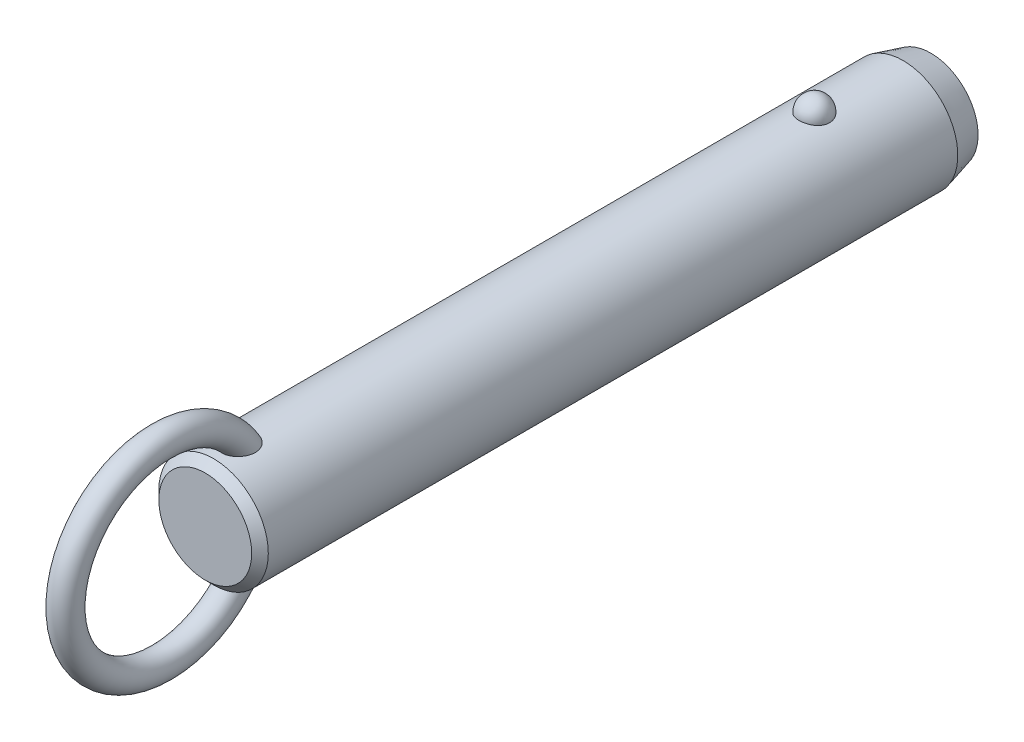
ISO-10303-21;
HEADER;
FILE_DESCRIPTION(('STEP AP214'),'2;1');
FILE_NAME('part.step','',(''),(''),'','','');
FILE_SCHEMA(('AUTOMOTIVE_DESIGN { 1 0 10303 214 1 1 1 1 }'));
ENDSEC;
DATA;
#1=APPLICATION_CONTEXT('core data for automotive mechanical design processes');
#2=APPLICATION_PROTOCOL_DEFINITION('international standard','automotive_design',2000,#1);
#3=PRODUCT_CONTEXT('',#1,'mechanical');
#4=PRODUCT('Part','Part','',(#3));
#5=PRODUCT_RELATED_PRODUCT_CATEGORY('part','',(#4));
#6=PRODUCT_DEFINITION_FORMATION('','',#4);
#7=PRODUCT_DEFINITION_CONTEXT('part definition',#1,'design');
#8=PRODUCT_DEFINITION('design','',#6,#7);
#9=PRODUCT_DEFINITION_SHAPE('','',#8);
#10=(LENGTH_UNIT() NAMED_UNIT(*) SI_UNIT(.MILLI.,.METRE.));
#11=(NAMED_UNIT(*) PLANE_ANGLE_UNIT() SI_UNIT($,.RADIAN.));
#12=(NAMED_UNIT(*) SI_UNIT($,.STERADIAN.) SOLID_ANGLE_UNIT());
#13=UNCERTAINTY_MEASURE_WITH_UNIT(LENGTH_MEASURE(1.E-05),#10,'distance_accuracy_value','');
#14=(GEOMETRIC_REPRESENTATION_CONTEXT(3) GLOBAL_UNCERTAINTY_ASSIGNED_CONTEXT((#13)) GLOBAL_UNIT_ASSIGNED_CONTEXT((#10,
#11,#12)) REPRESENTATION_CONTEXT('',''));
#15=CARTESIAN_POINT('',(0.,0.,0.));
#16=DIRECTION('',(0.,0.,1.));
#17=DIRECTION('',(1.,0.,0.));
#18=AXIS2_PLACEMENT_3D('',#15,#16,#17);
#19=CARTESIAN_POINT('',(0.,0.,76.2));
#20=DIRECTION('',(0.,0.,-1.));
#21=DIRECTION('',(-1.,0.,0.));
#22=AXIS2_PLACEMENT_3D('',#19,#20,#21);
#23=CYLINDRICAL_SURFACE('',#22,7.9);
#24=CARTESIAN_POINT('',(2.1785689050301,7.59367088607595,-2.19999999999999));
#25=CARTESIAN_POINT('',(2.17856679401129,7.59367269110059,-2.07701843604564));
#26=CARTESIAN_POINT('',(2.16853481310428,7.59657145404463,-1.95401006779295));
#27=CARTESIAN_POINT('',(2.12864689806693,7.607843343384,-1.71147811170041));
#28=CARTESIAN_POINT('',(2.09878338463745,7.61621856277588,-1.59195587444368));
#29=CARTESIAN_POINT('',(2.0199931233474,7.63749180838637,-1.3598563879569));
#30=CARTESIAN_POINT('',(1.97107475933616,7.65038784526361,-1.24727610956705));
#31=CARTESIAN_POINT('',(1.85539377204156,7.67926115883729,-1.03213234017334));
#32=CARTESIAN_POINT('',(1.78863158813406,7.69523835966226,-0.929568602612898));
#33=CARTESIAN_POINT('',(1.63856494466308,7.7285848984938,-0.736786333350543));
#34=CARTESIAN_POINT('',(1.55518140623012,7.7459606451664,-0.646630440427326));
#35=CARTESIAN_POINT('',(1.37422937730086,7.78009978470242,-0.481747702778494));
#36=CARTESIAN_POINT('',(1.27666086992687,7.7968631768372,-0.407020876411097));
#37=CARTESIAN_POINT('',(1.07024728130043,7.82786153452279,-0.275278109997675));
#38=CARTESIAN_POINT('',(0.961434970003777,7.84210353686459,-0.218212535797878));
#39=CARTESIAN_POINT('',(0.735351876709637,7.86652194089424,-0.123146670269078));
#40=CARTESIAN_POINT('',(0.618082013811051,7.87669878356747,-0.0851443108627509));
#41=CARTESIAN_POINT('',(0.380637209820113,7.89170521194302,-0.0298158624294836));
#42=CARTESIAN_POINT('',(0.260550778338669,7.89662650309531,-0.0121347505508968));
#43=CARTESIAN_POINT('',(0.0190117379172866,7.90090003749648,0.00324379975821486));
#44=CARTESIAN_POINT('',(-0.10244074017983,7.90025280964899,0.000943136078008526));
#45=CARTESIAN_POINT('',(-0.341452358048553,7.89351056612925,-0.0233955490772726));
#46=CARTESIAN_POINT('',(-0.45904225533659,7.88749257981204,-0.0451545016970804));
#47=CARTESIAN_POINT('',(-0.688796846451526,7.87075812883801,-0.107408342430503));
#48=CARTESIAN_POINT('',(-0.800961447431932,7.86004158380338,-0.147903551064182));
#49=CARTESIAN_POINT('',(-1.01743634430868,7.83497131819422,-0.246799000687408));
#50=CARTESIAN_POINT('',(-1.12169791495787,7.82059709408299,-0.305300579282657));
#51=CARTESIAN_POINT('',(-1.31891765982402,7.78976470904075,-0.438549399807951));
#52=CARTESIAN_POINT('',(-1.41187469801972,7.77330633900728,-0.513298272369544));
#53=CARTESIAN_POINT('',(-1.58577142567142,7.73972434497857,-0.678622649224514));
#54=CARTESIAN_POINT('',(-1.66645140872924,7.72259402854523,-0.769470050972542));
#55=CARTESIAN_POINT('',(-1.81161503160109,7.68983776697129,-0.963538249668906));
#56=CARTESIAN_POINT('',(-1.87609753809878,7.6742119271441,-1.06675991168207));
#57=CARTESIAN_POINT('',(-1.98790138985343,7.6460202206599,-1.28401170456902));
#58=CARTESIAN_POINT('',(-2.03501994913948,7.63349104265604,-1.39815107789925));
#59=CARTESIAN_POINT('',(-2.10986724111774,7.6131449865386,-1.63301784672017));
#60=CARTESIAN_POINT('',(-2.1375965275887,7.60532797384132,-1.75374505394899));
#61=CARTESIAN_POINT('',(-2.17289256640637,7.59531950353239,-1.99782562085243));
#62=CARTESIAN_POINT('',(-2.18054294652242,7.59310471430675,-2.12116592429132));
#63=CARTESIAN_POINT('',(-2.17572919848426,7.59448538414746,-2.36741799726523));
#64=CARTESIAN_POINT('',(-2.1632656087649,7.59808068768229,-2.49032977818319));
#65=CARTESIAN_POINT('',(-2.11865035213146,7.61064035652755,-2.73161015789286));
#66=CARTESIAN_POINT('',(-2.08659579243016,7.61957823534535,-2.84999812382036));
#67=CARTESIAN_POINT('',(-2.00367799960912,7.64179982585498,-3.07955956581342));
#68=CARTESIAN_POINT('',(-1.9528140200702,7.65508371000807,-3.19073275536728));
#69=CARTESIAN_POINT('',(-1.83321113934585,7.68460381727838,-3.40337899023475));
#70=CARTESIAN_POINT('',(-1.76437735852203,7.70085556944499,-3.50479651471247));
#71=CARTESIAN_POINT('',(-1.61069526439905,7.73445734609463,-3.69446912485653));
#72=CARTESIAN_POINT('',(-1.52584634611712,7.75180741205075,-3.78272371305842));
#73=CARTESIAN_POINT('',(-1.34198059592,7.78574608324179,-3.94393987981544));
#74=CARTESIAN_POINT('',(-1.24291308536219,7.80233167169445,-4.01684434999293));
#75=CARTESIAN_POINT('',(-1.03352039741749,7.83281625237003,-4.14489386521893));
#76=CARTESIAN_POINT('',(-0.923196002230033,7.84671543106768,-4.20004014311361));
#77=CARTESIAN_POINT('',(-0.695822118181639,7.87011575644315,-4.29042017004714));
#78=CARTESIAN_POINT('',(-0.578872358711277,7.87966903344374,-4.32589112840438));
#79=CARTESIAN_POINT('',(-0.340410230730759,7.8935652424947,-4.37692226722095));
#80=CARTESIAN_POINT('',(-0.218898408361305,7.89790879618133,-4.39248482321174));
#81=CARTESIAN_POINT('',(0.0228107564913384,7.90087453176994,-4.40314405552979));
#82=CARTESIAN_POINT('',(0.142990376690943,7.89960185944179,-4.39861683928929));
#83=CARTESIAN_POINT('',(0.380829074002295,7.89171262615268,-4.37008293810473));
#84=CARTESIAN_POINT('',(0.498488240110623,7.8850962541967,-4.34607694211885));
#85=CARTESIAN_POINT('',(0.727535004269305,7.86726442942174,-4.27939317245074));
#86=CARTESIAN_POINT('',(0.838944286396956,7.85606616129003,-4.236785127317));
#87=CARTESIAN_POINT('',(1.05295421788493,7.83025654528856,-4.13408348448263));
#88=CARTESIAN_POINT('',(1.15555431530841,7.81564498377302,-4.07398879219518));
#89=CARTESIAN_POINT('',(1.35076763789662,7.7843022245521,-3.93687432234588));
#90=CARTESIAN_POINT('',(1.4432046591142,7.76754209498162,-3.85961036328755));
#91=CARTESIAN_POINT('',(1.6139111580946,7.73387857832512,-3.69076949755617));
#92=CARTESIAN_POINT('',(1.6921781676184,7.71697516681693,-3.59919010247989));
#93=CARTESIAN_POINT('',(1.83380875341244,7.6845643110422,-3.40247278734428));
#94=CARTESIAN_POINT('',(1.89689280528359,7.66908588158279,-3.29712873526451));
#95=CARTESIAN_POINT('',(2.0047823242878,7.64159441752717,-3.07707931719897));
#96=CARTESIAN_POINT('',(2.0495945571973,7.62958010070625,-2.96237743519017));
#97=CARTESIAN_POINT('',(2.11580183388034,7.61146617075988,-2.74040519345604));
#98=CARTESIAN_POINT('',(2.13929812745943,7.60484503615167,-2.63379846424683));
#99=CARTESIAN_POINT('',(2.17068242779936,7.59594664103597,-2.41813481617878));
#100=CARTESIAN_POINT('',(2.17857077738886,7.59366928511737,-2.30907795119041));
#101=CARTESIAN_POINT('',(2.1785689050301,7.59367088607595,-2.19999999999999));
#102=B_SPLINE_CURVE_WITH_KNOTS('',3,(#24,#25,#26,#27,#28,#29,#30,#31,#32,#33,#34,#35,#36,#37,
#38,#39,#40,#41,#42,#43,#44,#45,#46,#47,#48,#49,#50,#51,#52,#53,#54,#55,#56,#57,#58,#59,#60,#61,
#62,#63,#64,#65,#66,#67,#68,#69,#70,#71,#72,#73,#74,#75,#76,#77,#78,#79,#80,#81,#82,#83,#84,#85,
#86,#87,#88,#89,#90,#91,#92,#93,#94,#95,#96,#97,#98,#99,#100,#101),.UNSPECIFIED.,.T.,.F.,(4,2,2,
2,2,2,2,2,2,2,2,2,2,2,2,2,2,2,2,2,2,2,2,2,2,2,2,2,2,2,2,2,2,2,2,2,2,2,4),(0.,0.368552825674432,
0.737246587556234,1.10577831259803,1.4743009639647,1.84462067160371,2.21494081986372,
2.58421058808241,2.95344028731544,3.31611630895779,3.67875788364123,4.03628044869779,
4.39380913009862,4.75338791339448,5.11300280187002,5.47939989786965,5.8458226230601,
6.21639834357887,6.58696347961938,6.95598276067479,7.32499216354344,7.69218715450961,
8.0593967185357,8.42858578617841,8.79778880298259,9.16834203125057,9.5388695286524,
9.90482699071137,10.2707407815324,10.6298333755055,10.9889132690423,11.3466585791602,
11.7044262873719,12.0676511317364,12.4309391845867,12.8004764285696,13.1698767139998,
13.4967701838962,13.8236564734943),.UNSPECIFIED.);
#103=CARTESIAN_POINT('',(2.1785689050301,7.59367088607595,-2.19999999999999));
#104=VERTEX_POINT('',#103);
#105=EDGE_CURVE('E41',#104,#104,#102,.T.);
#106=ORIENTED_EDGE('',*,*,#105,.T.);
#107=EDGE_LOOP('',(#106));
#108=FACE_BOUND('',#107,.T.);
#109=CARTESIAN_POINT('',(0.,0.,84.52));
#110=DIRECTION('',(0.,0.,1.));
#111=DIRECTION('',(1.,0.,0.));
#112=AXIS2_PLACEMENT_3D('',#109,#110,#111);
#113=CIRCLE('',#112,7.9);
#114=CARTESIAN_POINT('',(7.9,0.,84.52));
#115=VERTEX_POINT('',#114);
#116=EDGE_CURVE('E10',#115,#115,#113,.F.);
#117=ORIENTED_EDGE('',*,*,#116,.T.);
#118=EDGE_LOOP('',(#117));
#119=FACE_BOUND('',#118,.T.);
#120=CARTESIAN_POINT('',(-0.630969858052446,-7.87476203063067,78.4124322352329));
#121=CARTESIAN_POINT('',(-0.734180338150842,-7.8664899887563,78.447285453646));
#122=CARTESIAN_POINT('',(-0.834476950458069,-7.85639291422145,78.4908160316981));
#123=CARTESIAN_POINT('',(-1.0262035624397,-7.83366343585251,78.5940948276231));
#124=CARTESIAN_POINT('',(-1.1176141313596,-7.82102565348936,78.6538775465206));
#125=CARTESIAN_POINT('',(-1.28877277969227,-7.79464922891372,78.7878390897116));
#126=CARTESIAN_POINT('',(-1.36854014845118,-7.78091246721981,78.861993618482));
#127=CARTESIAN_POINT('',(-1.5146152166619,-7.75380398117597,79.0224941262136));
#128=CARTESIAN_POINT('',(-1.58092966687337,-7.74043207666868,79.1088339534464));
#129=CARTESIAN_POINT('',(-1.70019064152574,-7.71512522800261,79.2929784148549));
#130=CARTESIAN_POINT('',(-1.75284037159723,-7.70322473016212,79.3909792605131));
#131=CARTESIAN_POINT('',(-1.84263464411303,-7.68224112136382,79.5941029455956));
#132=CARTESIAN_POINT('',(-1.87977299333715,-7.6731591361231,79.6992286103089));
#133=CARTESIAN_POINT('',(-1.94152728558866,-7.65777930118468,79.9232849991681));
#134=CARTESIAN_POINT('',(-1.96475471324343,-7.65179654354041,80.0426167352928));
#135=CARTESIAN_POINT('',(-1.99449499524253,-7.64409642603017,80.2834298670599));
#136=CARTESIAN_POINT('',(-2.0010005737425,-7.64238092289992,80.4049121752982));
#137=CARTESIAN_POINT('',(-1.99856014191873,-7.64302120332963,80.6683409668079));
#138=CARTESIAN_POINT('',(-1.98680021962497,-7.64611845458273,80.8102565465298));
#139=CARTESIAN_POINT('',(-1.94457772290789,-7.65696186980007,81.0911188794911));
#140=CARTESIAN_POINT('',(-1.91409393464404,-7.66471330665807,81.2300620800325));
#141=CARTESIAN_POINT('',(-1.82768670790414,-7.68582947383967,81.531939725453));
#142=CARTESIAN_POINT('',(-1.76772963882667,-7.70003779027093,81.693686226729));
#143=CARTESIAN_POINT('',(-1.65998501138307,-7.72371550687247,81.9276956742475));
#144=CARTESIAN_POINT('',(-1.621079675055,-7.73200670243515,82.0042974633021));
#145=CARTESIAN_POINT('',(-1.53727726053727,-7.74910377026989,82.1540798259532));
#146=CARTESIAN_POINT('',(-1.49238215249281,-7.75790947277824,82.2272615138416));
#147=CARTESIAN_POINT('',(-1.3739705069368,-7.77993338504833,82.4028838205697));
#148=CARTESIAN_POINT('',(-1.29690364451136,-7.79328473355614,82.5029557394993));
#149=CARTESIAN_POINT('',(-1.12885487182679,-7.81939266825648,82.6907147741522));
#150=CARTESIAN_POINT('',(-1.03789926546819,-7.83215032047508,82.7784247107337));
#151=CARTESIAN_POINT('',(-0.869532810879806,-7.85231710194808,82.9134148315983));
#152=CARTESIAN_POINT('',(-0.795716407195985,-7.86021093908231,82.965076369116));
#153=CARTESIAN_POINT('',(-0.640813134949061,-7.87434920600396,83.0563815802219));
#154=CARTESIAN_POINT('',(-0.559737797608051,-7.88059619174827,83.0960438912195));
#155=CARTESIAN_POINT('',(-0.406456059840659,-7.88984116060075,83.1543008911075));
#156=CARTESIAN_POINT('',(-0.335227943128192,-7.89321892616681,83.1753848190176));
#157=CARTESIAN_POINT('',(-0.190193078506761,-7.89804235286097,83.2054141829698));
#158=CARTESIAN_POINT('',(-0.116388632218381,-7.89948969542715,83.2143701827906));
#159=CARTESIAN_POINT('',(0.0318414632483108,-7.90028409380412,83.2192915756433));
#160=CARTESIAN_POINT('',(0.106268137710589,-7.89962640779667,83.2152276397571));
#161=CARTESIAN_POINT('',(0.253290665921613,-7.8962818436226,83.1944615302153));
#162=CARTESIAN_POINT('',(0.32588518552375,-7.8935935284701,83.1777504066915));
#163=CARTESIAN_POINT('',(0.481441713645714,-7.88577340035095,83.1287380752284));
#164=CARTESIAN_POINT('',(0.563611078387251,-7.88026321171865,83.094005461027));
#165=CARTESIAN_POINT('',(0.721129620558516,-7.86741729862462,83.0117965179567));
#166=CARTESIAN_POINT('',(0.796466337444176,-7.86007832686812,82.9642975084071));
#167=CARTESIAN_POINT('',(0.971456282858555,-7.84073285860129,82.836513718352));
#168=CARTESIAN_POINT('',(1.06719686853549,-7.82809461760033,82.7510047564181));
#169=CARTESIAN_POINT('',(1.24418921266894,-7.80192439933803,82.566232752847));
#170=CARTESIAN_POINT('',(1.32540832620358,-7.78839049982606,82.4669395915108));
#171=CARTESIAN_POINT('',(1.45199971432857,-7.76559693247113,82.2895760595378));
#172=CARTESIAN_POINT('',(1.5008564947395,-7.75626094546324,82.2139542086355));
#173=CARTESIAN_POINT('',(1.59197749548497,-7.7380727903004,82.0587428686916));
#174=CARTESIAN_POINT('',(1.63423919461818,-7.72922080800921,81.9791518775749));
#175=CARTESIAN_POINT('',(1.71222612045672,-7.71231959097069,81.8166640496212));
#176=CARTESIAN_POINT('',(1.7479451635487,-7.70427111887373,81.733764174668));
#177=CARTESIAN_POINT('',(1.81270113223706,-7.68929240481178,81.5652967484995));
#178=CARTESIAN_POINT('',(1.84173789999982,-7.68236218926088,81.4797291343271));
#179=CARTESIAN_POINT('',(1.89322698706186,-7.6698375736,81.3052870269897));
#180=CARTESIAN_POINT('',(1.91558744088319,-7.66426199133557,81.2163838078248));
#181=CARTESIAN_POINT('',(1.95281367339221,-7.65485915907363,81.0369696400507));
#182=CARTESIAN_POINT('',(1.96767946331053,-7.65103190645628,80.9464586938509));
#183=CARTESIAN_POINT('',(2.00021456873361,-7.64262981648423,80.6737320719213));
#184=CARTESIAN_POINT('',(2.00600691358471,-7.6410871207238,80.4897099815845));
#185=CARTESIAN_POINT('',(1.98445334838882,-7.64669564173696,80.1765019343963));
#186=CARTESIAN_POINT('',(1.96607186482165,-7.65149688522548,80.046618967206));
#187=CARTESIAN_POINT('',(1.90884967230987,-7.6659762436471,79.7916321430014));
#188=CARTESIAN_POINT('',(1.87002101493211,-7.67565148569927,79.666525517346));
#189=CARTESIAN_POINT('',(1.77063986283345,-7.69918471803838,79.4245401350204));
#190=CARTESIAN_POINT('',(1.7099372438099,-7.71307150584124,79.3077250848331));
#191=CARTESIAN_POINT('',(1.56733070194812,-7.74330306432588,79.0881444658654));
#192=CARTESIAN_POINT('',(1.48543692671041,-7.75964665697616,78.9853722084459));
#193=CARTESIAN_POINT('',(1.31346177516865,-7.79047523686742,78.8093800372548));
#194=CARTESIAN_POINT('',(1.22547278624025,-7.80495298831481,78.7341066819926));
#195=CARTESIAN_POINT('',(1.03724352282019,-7.83218597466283,78.6004864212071));
#196=CARTESIAN_POINT('',(0.937008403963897,-7.84494192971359,78.5421324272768));
#197=CARTESIAN_POINT('',(0.733599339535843,-7.86649045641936,78.4470270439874));
#198=CARTESIAN_POINT('',(0.630941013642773,-7.87547134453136,78.4092109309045));
#199=CARTESIAN_POINT('',(0.420465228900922,-7.88950708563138,78.3511160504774));
#200=CARTESIAN_POINT('',(0.312645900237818,-7.89456050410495,78.3308436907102));
#201=CARTESIAN_POINT('',(0.0960869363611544,-7.9001518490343,78.3084559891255));
#202=CARTESIAN_POINT('',(-0.0126341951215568,-7.90073226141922,78.3061698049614));
#203=CARTESIAN_POINT('',(-0.228766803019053,-7.89742350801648,78.3193678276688));
#204=CARTESIAN_POINT('',(-0.336180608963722,-7.89354403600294,78.3348134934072));
#205=CARTESIAN_POINT('',(-0.473410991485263,-7.88586871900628,78.3662177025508));
#206=CARTESIAN_POINT('',(-0.5052577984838,-7.88388984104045,78.3743541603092));
#207=CARTESIAN_POINT('',(-0.568481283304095,-7.87958326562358,78.3922083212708));
#208=CARTESIAN_POINT('',(-0.599857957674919,-7.87725556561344,78.4019260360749));
#209=CARTESIAN_POINT('',(-0.630969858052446,-7.87476203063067,78.4124322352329));
#210=B_SPLINE_CURVE_WITH_KNOTS('',3,(#120,#121,#122,#123,#124,#125,#126,#127,#128,#129,#130,
#131,#132,#133,#134,#135,#136,#137,#138,#139,#140,#141,#142,#143,#144,#145,#146,#147,#148,#149,
#150,#151,#152,#153,#154,#155,#156,#157,#158,#159,#160,#161,#162,#163,#164,#165,#166,#167,#168,
#169,#170,#171,#172,#173,#174,#175,#176,#177,#178,#179,#180,#181,#182,#183,#184,#185,#186,#187,
#188,#189,#190,#191,#192,#193,#194,#195,#196,#197,#198,#199,#200,#201,#202,#203,#204,#205,#206,
#207,#208,#209),.UNSPECIFIED.,.T.,.F.,(4,2,2,2,2,2,2,2,2,2,2,2,2,2,2,2,2,2,2,2,2,2,2,2,2,2,2,2,
2,2,2,2,2,2,2,2,2,2,2,2,2,2,2,2,4),(0.,0.327622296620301,0.655945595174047,0.983718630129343,
1.3113267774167,1.64554655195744,1.97989964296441,2.3436572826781,2.70757317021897,
3.13333684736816,3.55958380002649,4.07655306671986,4.33527897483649,4.59391999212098,
4.9738243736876,5.35301797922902,5.62348245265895,5.89352465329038,6.11565959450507,
6.3376009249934,6.56004255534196,6.78264174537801,7.04930844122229,7.31645206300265,
7.70130871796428,8.08701995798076,8.35824509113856,8.62957365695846,8.9011573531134,
9.17274746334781,9.44791855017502,9.72308922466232,10.2715298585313,10.6638393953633,
11.0559179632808,11.4507403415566,11.845374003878,12.1936425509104,12.5417649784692,
12.8695063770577,13.1973674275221,13.5221104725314,13.8461490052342,13.9449071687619,
14.0436660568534),.UNSPECIFIED.);
#211=CARTESIAN_POINT('',(-0.630969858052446,-7.87476203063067,78.4124322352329));
#212=VERTEX_POINT('',#211);
#213=EDGE_CURVE('E60',#212,#212,#210,.T.);
#214=ORIENTED_EDGE('',*,*,#213,.T.);
#215=EDGE_LOOP('',(#214));
#216=FACE_BOUND('',#215,.T.);
#217=CARTESIAN_POINT('',(-0.630969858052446,7.87476203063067,78.4124322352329));
#218=CARTESIAN_POINT('',(-0.52891882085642,7.88293636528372,78.3779798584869));
#219=CARTESIAN_POINT('',(-0.423745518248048,7.8893481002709,78.351915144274));
#220=CARTESIAN_POINT('',(-0.210236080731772,7.8979273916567,78.3172825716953));
#221=CARTESIAN_POINT('',(-0.101893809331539,7.90008607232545,78.3087513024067));
#222=CARTESIAN_POINT('',(0.114660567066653,7.89990877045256,78.3094570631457));
#223=CARTESIAN_POINT('',(0.222872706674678,7.89757640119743,78.3186798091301));
#224=CARTESIAN_POINT('',(0.436107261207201,7.88867538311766,78.3546525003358));
#225=CARTESIAN_POINT('',(0.541131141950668,7.8821087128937,78.3813942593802));
#226=CARTESIAN_POINT('',(0.745085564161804,7.86545130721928,78.4517561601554));
#227=CARTESIAN_POINT('',(0.844015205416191,7.85536005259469,78.4953787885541));
#228=CARTESIAN_POINT('',(1.03299167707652,7.83275153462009,78.5983796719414));
#229=CARTESIAN_POINT('',(1.12303841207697,7.8202342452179,78.6577580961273));
#230=CARTESIAN_POINT('',(1.29214734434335,7.79408219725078,78.7908647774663));
#231=CARTESIAN_POINT('',(1.37116907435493,7.78044359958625,78.8646436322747));
#232=CARTESIAN_POINT('',(1.51597677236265,7.75353170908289,79.0242353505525));
#233=CARTESIAN_POINT('',(1.58176261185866,7.74025841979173,79.1100483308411));
#234=CARTESIAN_POINT('',(1.70057386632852,7.71504069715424,79.293644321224));
#235=CARTESIAN_POINT('',(1.75320073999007,7.7031425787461,79.3916906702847));
#236=CARTESIAN_POINT('',(1.8429376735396,7.68216822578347,79.5948931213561));
#237=CARTESIAN_POINT('',(1.88004278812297,7.67309289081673,79.7000514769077));
#238=CARTESIAN_POINT('',(1.9417232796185,7.6577294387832,79.9241671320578));
#239=CARTESIAN_POINT('',(1.96491037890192,7.65175648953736,80.0435248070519));
#240=CARTESIAN_POINT('',(1.9945689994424,7.64407702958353,80.2843848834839));
#241=CARTESIAN_POINT('',(2.00103304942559,7.64237242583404,80.4058882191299));
#242=CARTESIAN_POINT('',(1.9985016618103,7.64303650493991,80.6693688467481));
#243=CARTESIAN_POINT('',(1.98669038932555,7.64614714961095,80.8113141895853));
#244=CARTESIAN_POINT('',(1.94436120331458,7.6570170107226,81.0922287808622));
#245=CARTESIAN_POINT('',(1.9138220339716,7.66478150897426,81.2311944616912));
#246=CARTESIAN_POINT('',(1.82728754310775,7.68592483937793,81.5331110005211));
#247=CARTESIAN_POINT('',(1.76725778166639,7.7001468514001,81.694872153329));
#248=CARTESIAN_POINT('',(1.65939700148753,7.72384204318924,81.9288914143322));
#249=CARTESIAN_POINT('',(1.62045187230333,7.73213852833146,82.0054942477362));
#250=CARTESIAN_POINT('',(1.53656684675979,7.74924489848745,82.1552737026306));
#251=CARTESIAN_POINT('',(1.49162892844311,7.75805461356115,82.2284514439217));
#252=CARTESIAN_POINT('',(1.37317698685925,7.78007342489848,82.4039520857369));
#253=CARTESIAN_POINT('',(1.29612360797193,7.79341423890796,82.5039112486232));
#254=CARTESIAN_POINT('',(1.12812043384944,7.81949839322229,82.6914508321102));
#255=CARTESIAN_POINT('',(1.03719688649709,7.83224280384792,82.7790540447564));
#256=CARTESIAN_POINT('',(0.868871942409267,7.85239026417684,82.9138971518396));
#257=CARTESIAN_POINT('',(0.795056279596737,7.86027769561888,82.9655113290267));
#258=CARTESIAN_POINT('',(0.640160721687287,7.87440222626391,83.0567201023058));
#259=CARTESIAN_POINT('',(0.559092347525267,7.88064188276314,83.0963333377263));
#260=CARTESIAN_POINT('',(0.405820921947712,7.8898738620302,83.1545056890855));
#261=CARTESIAN_POINT('',(0.33459413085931,7.89324577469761,83.1755523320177));
#262=CARTESIAN_POINT('',(0.189568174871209,7.89805733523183,83.2055070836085));
#263=CARTESIAN_POINT('',(0.115771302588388,7.89949866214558,83.2144257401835));
#264=CARTESIAN_POINT('',(-0.032435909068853,7.90028156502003,83.2192758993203));
#265=CARTESIAN_POINT('',(-0.106847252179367,7.89961843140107,83.2151782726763));
#266=CARTESIAN_POINT('',(-0.253834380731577,7.8962642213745,83.1943519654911));
#267=CARTESIAN_POINT('',(-0.326408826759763,7.89357170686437,83.1776143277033));
#268=CARTESIAN_POINT('',(-0.481962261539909,7.88574179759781,83.1285391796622));
#269=CARTESIAN_POINT('',(-0.564145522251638,7.88022507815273,83.0937638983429));
#270=CARTESIAN_POINT('',(-0.721685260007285,7.8673664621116,83.0114686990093));
#271=CARTESIAN_POINT('',(-0.797029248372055,7.8600213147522,82.9639260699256));
#272=CARTESIAN_POINT('',(-0.972044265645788,7.84066026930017,82.8360267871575));
#273=CARTESIAN_POINT('',(-1.06779803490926,7.82801274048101,82.7504436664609));
#274=CARTESIAN_POINT('',(-1.24480531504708,7.80182621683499,82.5655223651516));
#275=CARTESIAN_POINT('',(-1.32602618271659,7.78828530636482,82.4661540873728));
#276=CARTESIAN_POINT('',(-1.45259834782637,7.76548487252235,82.2886806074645));
#277=CARTESIAN_POINT('',(-1.50143856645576,7.75614818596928,82.2130252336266));
#278=CARTESIAN_POINT('',(-1.59252410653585,7.73796020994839,82.0577484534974));
#279=CARTESIAN_POINT('',(-1.63476690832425,7.72910910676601,81.9781255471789));
#280=CARTESIAN_POINT('',(-1.71271318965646,7.71221133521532,81.8155750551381));
#281=CARTESIAN_POINT('',(-1.74841047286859,7.70416543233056,81.7326444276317));
#282=CARTESIAN_POINT('',(-1.81311929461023,7.6891937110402,81.5641168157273));
#283=CARTESIAN_POINT('',(-1.84213067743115,7.6822679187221,81.4785197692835));
#284=CARTESIAN_POINT('',(-1.89356259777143,7.66975461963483,81.3040254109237));
#285=CARTESIAN_POINT('',(-1.91589165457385,7.66418586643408,81.2150995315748));
#286=CARTESIAN_POINT('',(-1.95305070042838,7.65479859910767,81.0356424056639));
#287=CARTESIAN_POINT('',(-1.96788069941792,7.65098008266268,80.9451111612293));
#288=CARTESIAN_POINT('',(-2.00030078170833,7.64260704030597,80.6723270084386));
#289=CARTESIAN_POINT('',(-2.00600576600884,7.64108760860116,80.4882718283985));
#290=CARTESIAN_POINT('',(-1.98428483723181,7.64673945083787,80.1750800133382));
#291=CARTESIAN_POINT('',(-1.96583698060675,7.6515575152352,80.0452400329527));
#292=CARTESIAN_POINT('',(-1.90848948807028,7.66606613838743,79.7903619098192));
#293=CARTESIAN_POINT('',(-1.86960376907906,7.67575338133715,79.665320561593));
#294=CARTESIAN_POINT('',(-1.7701342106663,7.6993013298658,79.4235009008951));
#295=CARTESIAN_POINT('',(-1.70940488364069,7.71318991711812,79.3067844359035));
#296=CARTESIAN_POINT('',(-1.56672953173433,7.74342495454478,79.0873404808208));
#297=CARTESIAN_POINT('',(-1.48478316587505,7.75977144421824,78.9846132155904));
#298=CARTESIAN_POINT('',(-1.31266325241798,7.79061163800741,78.8086431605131));
#299=CARTESIAN_POINT('',(-1.22456383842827,7.80509908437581,78.7333589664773));
#300=CARTESIAN_POINT('',(-1.03622400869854,7.83231881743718,78.5998659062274));
#301=CARTESIAN_POINT('',(-0.936015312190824,7.84505551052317,78.5416137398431));
#302=CARTESIAN_POINT('',(-0.798824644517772,7.85957802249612,78.4775408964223));
#303=CARTESIAN_POINT('',(-0.765787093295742,7.86286821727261,78.4632248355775));
#304=CARTESIAN_POINT('',(-0.69893958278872,7.86909211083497,78.436436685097));
#305=CARTESIAN_POINT('',(-0.665129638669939,7.8720258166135,78.4239645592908));
#306=CARTESIAN_POINT('',(-0.630969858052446,7.87476203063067,78.4124322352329));
#307=B_SPLINE_CURVE_WITH_KNOTS('',3,(#217,#218,#219,#220,#221,#222,#223,#224,#225,#226,#227,
#228,#229,#230,#231,#232,#233,#234,#235,#236,#237,#238,#239,#240,#241,#242,#243,#244,#245,#246,
#247,#248,#249,#250,#251,#252,#253,#254,#255,#256,#257,#258,#259,#260,#261,#262,#263,#264,#265,
#266,#267,#268,#269,#270,#271,#272,#273,#274,#275,#276,#277,#278,#279,#280,#281,#282,#283,#284,
#285,#286,#287,#288,#289,#290,#291,#292,#293,#294,#295,#296,#297,#298,#299,#300,#301,#302,#303,
#304,#305,#306),.UNSPECIFIED.,.T.,.F.,(4,2,2,2,2,2,2,2,2,2,2,2,2,2,2,2,2,2,2,2,2,2,2,2,2,2,2,2,
2,2,2,2,2,2,2,2,2,2,2,2,2,2,2,2,4),(0.,0.323920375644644,0.648516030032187,0.97285063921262,
1.29703380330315,1.62126473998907,1.94549915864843,2.27089401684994,2.5962920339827,
2.93059633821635,3.26500707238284,3.62881644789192,3.99278833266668,4.41865421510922,
4.84500434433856,5.36209210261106,5.62087589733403,5.87957448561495,6.25918598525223,
6.63808782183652,6.90846748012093,7.17842501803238,7.40052350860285,7.62242871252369,
7.84483086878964,8.06739077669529,8.33414615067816,8.60137921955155,8.98641454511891,
9.37230415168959,9.6435867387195,9.91497268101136,10.1866142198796,10.4582620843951,
10.7334745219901,11.0086865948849,11.5572126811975,11.9494246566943,12.3413699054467,
12.7359755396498,13.1305875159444,13.4791770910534,13.82687259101,13.9353013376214,
14.0437279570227),.UNSPECIFIED.);
#308=CARTESIAN_POINT('',(-0.630969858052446,7.87476203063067,78.4124322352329));
#309=VERTEX_POINT('',#308);
#310=EDGE_CURVE('E68',#309,#309,#307,.T.);
#311=ORIENTED_EDGE('',*,*,#310,.T.);
#312=EDGE_LOOP('',(#311));
#313=FACE_BOUND('',#312,.T.);
#314=CARTESIAN_POINT('',(0.,0.,-15.));
#315=DIRECTION('',(0.,0.,-1.));
#316=DIRECTION('',(-1.,0.,0.));
#317=AXIS2_PLACEMENT_3D('',#314,#315,#316);
#318=CIRCLE('',#317,7.9);
#319=CARTESIAN_POINT('',(-7.9,0.,-15.));
#320=VERTEX_POINT('',#319);
#321=EDGE_CURVE('E57',#320,#320,#318,.F.);
#322=ORIENTED_EDGE('',*,*,#321,.T.);
#323=EDGE_LOOP('',(#322));
#324=FACE_BOUND('',#323,.T.);
#325=ADVANCED_FACE('F37',(#108,#119,#216,#313,#324),#23,.T.);
#326=CARTESIAN_POINT('',(0.,0.,-19.));
#327=DIRECTION('',(0.,0.,-1.));
#328=DIRECTION('',(-1.,0.,0.));
#329=AXIS2_PLACEMENT_3D('',#326,#327,#328);
#330=PLANE('',#329);
#331=CARTESIAN_POINT('',(0.,0.,-19.));
#332=DIRECTION('',(0.,0.,-1.));
#333=DIRECTION('',(-1.,0.,0.));
#334=AXIS2_PLACEMENT_3D('',#331,#332,#333);
#335=CIRCLE('',#334,6.82820323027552);
#336=CARTESIAN_POINT('',(-6.82820323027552,0.,-19.));
#337=VERTEX_POINT('',#336);
#338=EDGE_CURVE('E67',#337,#337,#335,.T.);
#339=ORIENTED_EDGE('',*,*,#338,.T.);
#340=EDGE_LOOP('',(#339));
#341=FACE_BOUND('',#340,.T.);
#342=ADVANCED_FACE('F86',(#341),#330,.T.);
#343=CARTESIAN_POINT('',(0.,0.,-19.));
#344=DIRECTION('',(0.,0.,1.));
#345=DIRECTION('',(1.,0.,0.));
#346=AXIS2_PLACEMENT_3D('',#343,#344,#345);
#347=CONICAL_SURFACE('',#346,6.82820323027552,0.26179938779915);
#348=ORIENTED_EDGE('',*,*,#321,.F.);
#349=EDGE_LOOP('',(#348));
#350=FACE_BOUND('',#349,.T.);
#351=ORIENTED_EDGE('',*,*,#338,.F.);
#352=EDGE_LOOP('',(#351));
#353=FACE_BOUND('',#352,.T.);
#354=ADVANCED_FACE('F84',(#350,#353),#347,.T.);
#355=CARTESIAN_POINT('',(0.,0.,85.72));
#356=DIRECTION('',(0.,0.,1.));
#357=DIRECTION('',(1.,0.,0.));
#358=AXIS2_PLACEMENT_3D('',#355,#356,#357);
#359=PLANE('',#358);
#360=CARTESIAN_POINT('',(0.,0.,85.72));
#361=DIRECTION('',(0.,0.,1.));
#362=DIRECTION('',(1.,0.,0.));
#363=AXIS2_PLACEMENT_3D('',#360,#361,#362);
#364=CIRCLE('',#363,6.70000000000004);
#365=CARTESIAN_POINT('',(6.70000000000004,0.,85.72));
#366=VERTEX_POINT('',#365);
#367=EDGE_CURVE('E50',#366,#366,#364,.T.);
#368=ORIENTED_EDGE('',*,*,#367,.T.);
#369=EDGE_LOOP('',(#368));
#370=FACE_BOUND('',#369,.T.);
#371=ADVANCED_FACE('F78',(#370),#359,.T.);
#372=CARTESIAN_POINT('',(0.,0.,92.05));
#373=DIRECTION('',(1.,0.,0.));
#374=DIRECTION('',(0.,0.,-1.));
#375=AXIS2_PLACEMENT_3D('',#372,#373,#374);
#376=TOROIDAL_SURFACE('',#375,13.85,2.);
#377=ORIENTED_EDGE('',*,*,#310,.F.);
#378=EDGE_LOOP('',(#377));
#379=FACE_BOUND('',#378,.T.);
#380=ORIENTED_EDGE('',*,*,#213,.F.);
#381=EDGE_LOOP('',(#380));
#382=FACE_BOUND('',#381,.T.);
#383=ADVANCED_FACE('F74',(#379,#382),#376,.T.);
#384=CARTESIAN_POINT('',(0.,0.,85.72));
#385=DIRECTION('',(0.,0.,-1.));
#386=DIRECTION('',(-1.,0.,0.));
#387=AXIS2_PLACEMENT_3D('',#384,#385,#386);
#388=CONICAL_SURFACE('',#387,6.70000000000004,0.785398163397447);
#389=ORIENTED_EDGE('',*,*,#116,.F.);
#390=EDGE_LOOP('',(#389));
#391=FACE_BOUND('',#390,.T.);
#392=ORIENTED_EDGE('',*,*,#367,.F.);
#393=EDGE_LOOP('',(#392));
#394=FACE_BOUND('',#393,.T.);
#395=ADVANCED_FACE('F39',(#391,#394),#388,.T.);
#396=CARTESIAN_POINT('',(0.,7.9,-2.19999999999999));
#397=DIRECTION('',(0.,1.,0.));
#398=DIRECTION('',(0.,0.,1.));
#399=AXIS2_PLACEMENT_3D('',#396,#397,#398);
#400=SPHERICAL_SURFACE('',#399,2.2);
#401=ORIENTED_EDGE('',*,*,#105,.F.);
#402=EDGE_LOOP('',(#401));
#403=FACE_BOUND('',#402,.T.);
#404=ADVANCED_FACE('F80',(#403),#400,.T.);
#405=CLOSED_SHELL('',(#325,#342,#354,#371,#383,#395,#404));
#406=MANIFOLD_SOLID_BREP('B2',#405);
#407=ADVANCED_BREP_SHAPE_REPRESENTATION('',(#18,#406),#14);
#408=SHAPE_DEFINITION_REPRESENTATION(#9,#407);
ENDSEC;
END-ISO-10303-21;
